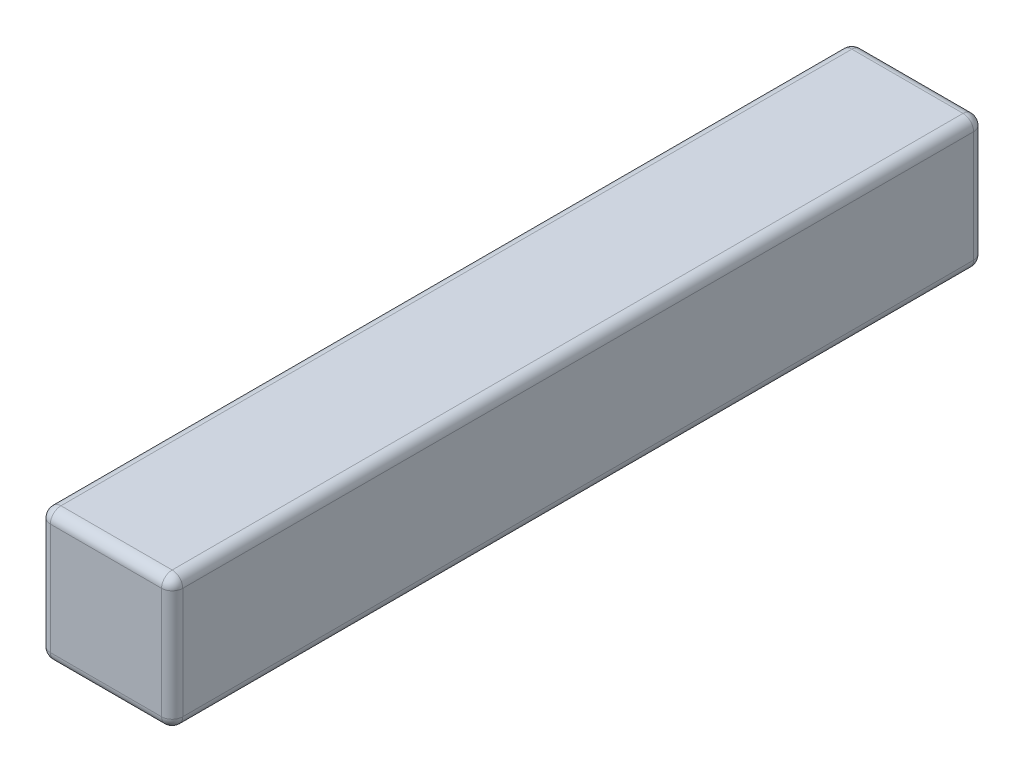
ISO-10303-21;
HEADER;
FILE_DESCRIPTION(('STEP AP214'),'2;1');
FILE_NAME('part.step','',(''),(''),'','','');
FILE_SCHEMA(('AUTOMOTIVE_DESIGN { 1 0 10303 214 1 1 1 1 }'));
ENDSEC;
DATA;
#1=APPLICATION_CONTEXT('core data for automotive mechanical design processes');
#2=APPLICATION_PROTOCOL_DEFINITION('international standard','automotive_design',2000,#1);
#3=PRODUCT_CONTEXT('',#1,'mechanical');
#4=PRODUCT('Part','Part','',(#3));
#5=PRODUCT_RELATED_PRODUCT_CATEGORY('part','',(#4));
#6=PRODUCT_DEFINITION_FORMATION('','',#4);
#7=PRODUCT_DEFINITION_CONTEXT('part definition',#1,'design');
#8=PRODUCT_DEFINITION('design','',#6,#7);
#9=PRODUCT_DEFINITION_SHAPE('','',#8);
#10=(LENGTH_UNIT() NAMED_UNIT(*) SI_UNIT(.MILLI.,.METRE.));
#11=(NAMED_UNIT(*) PLANE_ANGLE_UNIT() SI_UNIT($,.RADIAN.));
#12=(NAMED_UNIT(*) SI_UNIT($,.STERADIAN.) SOLID_ANGLE_UNIT());
#13=UNCERTAINTY_MEASURE_WITH_UNIT(LENGTH_MEASURE(1.E-05),#10,'distance_accuracy_value','');
#14=(GEOMETRIC_REPRESENTATION_CONTEXT(3) GLOBAL_UNCERTAINTY_ASSIGNED_CONTEXT((#13)) GLOBAL_UNIT_ASSIGNED_CONTEXT((#10,
#11,#12)) REPRESENTATION_CONTEXT('',''));
#15=CARTESIAN_POINT('',(0.,0.,0.));
#16=DIRECTION('',(0.,0.,1.));
#17=DIRECTION('',(1.,0.,0.));
#18=AXIS2_PLACEMENT_3D('',#15,#16,#17);
#19=CARTESIAN_POINT('',(18.75,18.75,115.));
#20=DIRECTION('',(-1.,0.,0.));
#21=DIRECTION('',(0.,-1.,0.));
#22=AXIS2_PLACEMENT_3D('',#19,#20,#21);
#23=PLANE('',#22);
#24=DIRECTION('',(0.,1.,0.));
#25=VECTOR('',#24,1.);
#26=CARTESIAN_POINT('',(18.75,-18.75,112.));
#27=LINE('',#26,#25);
#28=CARTESIAN_POINT('',(18.75,15.75,112.));
#29=VERTEX_POINT('',#28);
#30=CARTESIAN_POINT('',(18.75,-15.75,112.));
#31=VERTEX_POINT('',#30);
#32=EDGE_CURVE('E215',#29,#31,#27,.F.);
#33=ORIENTED_EDGE('',*,*,#32,.T.);
#34=DIRECTION('',(0.,0.,-1.));
#35=VECTOR('',#34,1.);
#36=CARTESIAN_POINT('',(18.75,-15.75,115.));
#37=LINE('',#36,#35);
#38=CARTESIAN_POINT('',(18.75,-15.75,-112.));
#39=VERTEX_POINT('',#38);
#40=EDGE_CURVE('E218',#31,#39,#37,.T.);
#41=ORIENTED_EDGE('',*,*,#40,.T.);
#42=DIRECTION('',(0.,1.,0.));
#43=VECTOR('',#42,1.);
#44=CARTESIAN_POINT('',(18.75,18.75,-112.));
#45=LINE('',#44,#43);
#46=CARTESIAN_POINT('',(18.75,15.75,-112.));
#47=VERTEX_POINT('',#46);
#48=EDGE_CURVE('E212',#39,#47,#45,.T.);
#49=ORIENTED_EDGE('',*,*,#48,.T.);
#50=DIRECTION('',(0.,0.,-1.));
#51=VECTOR('',#50,1.);
#52=CARTESIAN_POINT('',(18.75,15.75,115.));
#53=LINE('',#52,#51);
#54=EDGE_CURVE('E209',#47,#29,#53,.F.);
#55=ORIENTED_EDGE('',*,*,#54,.T.);
#56=EDGE_LOOP('',(#33,#41,#49,#55));
#57=FACE_BOUND('',#56,.T.);
#58=ADVANCED_FACE('F39',(#57),#23,.F.);
#59=CARTESIAN_POINT('',(-18.75,18.75,115.));
#60=DIRECTION('',(0.,-1.,0.));
#61=DIRECTION('',(0.,0.,-1.));
#62=AXIS2_PLACEMENT_3D('',#59,#60,#61);
#63=PLANE('',#62);
#64=DIRECTION('',(-1.,0.,0.));
#65=VECTOR('',#64,1.);
#66=CARTESIAN_POINT('',(18.75,18.75,112.));
#67=LINE('',#66,#65);
#68=CARTESIAN_POINT('',(-15.75,18.75,112.));
#69=VERTEX_POINT('',#68);
#70=CARTESIAN_POINT('',(15.75,18.75,112.));
#71=VERTEX_POINT('',#70);
#72=EDGE_CURVE('E49',#69,#71,#67,.F.);
#73=ORIENTED_EDGE('',*,*,#72,.T.);
#74=DIRECTION('',(0.,0.,-1.));
#75=VECTOR('',#74,1.);
#76=CARTESIAN_POINT('',(15.75,18.75,115.));
#77=LINE('',#76,#75);
#78=CARTESIAN_POINT('',(15.75,18.75,-112.));
#79=VERTEX_POINT('',#78);
#80=EDGE_CURVE('E11',#71,#79,#77,.T.);
#81=ORIENTED_EDGE('',*,*,#80,.T.);
#82=DIRECTION('',(-1.,0.,0.));
#83=VECTOR('',#82,1.);
#84=CARTESIAN_POINT('',(-18.75,18.75,-112.));
#85=LINE('',#84,#83);
#86=CARTESIAN_POINT('',(-15.75,18.75,-112.));
#87=VERTEX_POINT('',#86);
#88=EDGE_CURVE('E222',#79,#87,#85,.T.);
#89=ORIENTED_EDGE('',*,*,#88,.T.);
#90=DIRECTION('',(0.,0.,-1.));
#91=VECTOR('',#90,1.);
#92=CARTESIAN_POINT('',(-15.75,18.75,115.));
#93=LINE('',#92,#91);
#94=EDGE_CURVE('E60',#87,#69,#93,.F.);
#95=ORIENTED_EDGE('',*,*,#94,.T.);
#96=EDGE_LOOP('',(#73,#81,#89,#95));
#97=FACE_BOUND('',#96,.T.);
#98=ADVANCED_FACE('F349',(#97),#63,.F.);
#99=CARTESIAN_POINT('',(-18.75,18.75,115.));
#100=DIRECTION('',(1.,0.,0.));
#101=DIRECTION('',(0.,0.,-1.));
#102=AXIS2_PLACEMENT_3D('',#99,#100,#101);
#103=PLANE('',#102);
#104=DIRECTION('',(0.,-1.,0.));
#105=VECTOR('',#104,1.);
#106=CARTESIAN_POINT('',(-18.75,18.75,-112.));
#107=LINE('',#106,#105);
#108=CARTESIAN_POINT('',(-18.75,15.75,-112.));
#109=VERTEX_POINT('',#108);
#110=CARTESIAN_POINT('',(-18.75,-15.75,-112.));
#111=VERTEX_POINT('',#110);
#112=EDGE_CURVE('E189',#109,#111,#107,.T.);
#113=ORIENTED_EDGE('',*,*,#112,.T.);
#114=DIRECTION('',(0.,0.,-1.));
#115=VECTOR('',#114,1.);
#116=CARTESIAN_POINT('',(-18.75,-15.75,115.));
#117=LINE('',#116,#115);
#118=CARTESIAN_POINT('',(-18.75,-15.75,112.));
#119=VERTEX_POINT('',#118);
#120=EDGE_CURVE('E192',#111,#119,#117,.F.);
#121=ORIENTED_EDGE('',*,*,#120,.T.);
#122=DIRECTION('',(0.,-1.,0.));
#123=VECTOR('',#122,1.);
#124=CARTESIAN_POINT('',(-18.75,18.75,112.));
#125=LINE('',#124,#123);
#126=CARTESIAN_POINT('',(-18.75,15.75,112.));
#127=VERTEX_POINT('',#126);
#128=EDGE_CURVE('E186',#119,#127,#125,.F.);
#129=ORIENTED_EDGE('',*,*,#128,.T.);
#130=DIRECTION('',(0.,0.,-1.));
#131=VECTOR('',#130,1.);
#132=CARTESIAN_POINT('',(-18.75,15.75,115.));
#133=LINE('',#132,#131);
#134=EDGE_CURVE('E183',#127,#109,#133,.T.);
#135=ORIENTED_EDGE('',*,*,#134,.T.);
#136=EDGE_LOOP('',(#113,#121,#129,#135));
#137=FACE_BOUND('',#136,.T.);
#138=ADVANCED_FACE('F321',(#137),#103,.F.);
#139=CARTESIAN_POINT('',(-18.75,-18.75,115.));
#140=DIRECTION('',(0.,1.,0.));
#141=DIRECTION('',(0.,0.,1.));
#142=AXIS2_PLACEMENT_3D('',#139,#140,#141);
#143=PLANE('',#142);
#144=DIRECTION('',(0.,0.,-1.));
#145=VECTOR('',#144,1.);
#146=CARTESIAN_POINT('',(-15.75,-18.75,115.));
#147=LINE('',#146,#145);
#148=CARTESIAN_POINT('',(-15.75,-18.75,112.));
#149=VERTEX_POINT('',#148);
#150=CARTESIAN_POINT('',(-15.75,-18.75,-112.));
#151=VERTEX_POINT('',#150);
#152=EDGE_CURVE('E164',#149,#151,#147,.T.);
#153=ORIENTED_EDGE('',*,*,#152,.T.);
#154=DIRECTION('',(1.,0.,0.));
#155=VECTOR('',#154,1.);
#156=CARTESIAN_POINT('',(-18.75,-18.75,-112.));
#157=LINE('',#156,#155);
#158=CARTESIAN_POINT('',(15.75,-18.75,-112.));
#159=VERTEX_POINT('',#158);
#160=EDGE_CURVE('E133',#151,#159,#157,.T.);
#161=ORIENTED_EDGE('',*,*,#160,.T.);
#162=DIRECTION('',(0.,0.,-1.));
#163=VECTOR('',#162,1.);
#164=CARTESIAN_POINT('',(15.75,-18.75,115.));
#165=LINE('',#164,#163);
#166=CARTESIAN_POINT('',(15.75,-18.75,112.));
#167=VERTEX_POINT('',#166);
#168=EDGE_CURVE('E153',#159,#167,#165,.F.);
#169=ORIENTED_EDGE('',*,*,#168,.T.);
#170=DIRECTION('',(1.,0.,0.));
#171=VECTOR('',#170,1.);
#172=CARTESIAN_POINT('',(-18.75,-18.75,112.));
#173=LINE('',#172,#171);
#174=EDGE_CURVE('E160',#167,#149,#173,.F.);
#175=ORIENTED_EDGE('',*,*,#174,.T.);
#176=EDGE_LOOP('',(#153,#161,#169,#175));
#177=FACE_BOUND('',#176,.T.);
#178=ADVANCED_FACE('F162',(#177),#143,.F.);
#179=CARTESIAN_POINT('',(0.,0.,115.));
#180=DIRECTION('',(0.,0.,1.));
#181=DIRECTION('',(1.,0.,0.));
#182=AXIS2_PLACEMENT_3D('',#179,#180,#181);
#183=PLANE('',#182);
#184=DIRECTION('',(0.,-1.,0.));
#185=VECTOR('',#184,1.);
#186=CARTESIAN_POINT('',(-15.75,-18.75,115.));
#187=LINE('',#186,#185);
#188=CARTESIAN_POINT('',(-15.75,15.75,115.));
#189=VERTEX_POINT('',#188);
#190=CARTESIAN_POINT('',(-15.75,-15.75,115.));
#191=VERTEX_POINT('',#190);
#192=EDGE_CURVE('E202',#189,#191,#187,.T.);
#193=ORIENTED_EDGE('',*,*,#192,.T.);
#194=DIRECTION('',(1.,0.,0.));
#195=VECTOR('',#194,1.);
#196=CARTESIAN_POINT('',(18.75,-15.75,115.));
#197=LINE('',#196,#195);
#198=CARTESIAN_POINT('',(15.75,-15.75,115.));
#199=VERTEX_POINT('',#198);
#200=EDGE_CURVE('E205',#191,#199,#197,.T.);
#201=ORIENTED_EDGE('',*,*,#200,.T.);
#202=DIRECTION('',(0.,1.,0.));
#203=VECTOR('',#202,1.);
#204=CARTESIAN_POINT('',(15.75,18.75,115.));
#205=LINE('',#204,#203);
#206=CARTESIAN_POINT('',(15.75,15.75,115.));
#207=VERTEX_POINT('',#206);
#208=EDGE_CURVE('E199',#199,#207,#205,.T.);
#209=ORIENTED_EDGE('',*,*,#208,.T.);
#210=DIRECTION('',(-1.,0.,0.));
#211=VECTOR('',#210,1.);
#212=CARTESIAN_POINT('',(-18.75,15.75,115.));
#213=LINE('',#212,#211);
#214=EDGE_CURVE('E196',#207,#189,#213,.T.);
#215=ORIENTED_EDGE('',*,*,#214,.T.);
#216=EDGE_LOOP('',(#193,#201,#209,#215));
#217=FACE_BOUND('',#216,.T.);
#218=ADVANCED_FACE('F330',(#217),#183,.T.);
#219=CARTESIAN_POINT('',(0.,0.,-115.));
#220=DIRECTION('',(0.,0.,1.));
#221=DIRECTION('',(1.,0.,0.));
#222=AXIS2_PLACEMENT_3D('',#219,#220,#221);
#223=PLANE('',#222);
#224=DIRECTION('',(0.,1.,0.));
#225=VECTOR('',#224,1.);
#226=CARTESIAN_POINT('',(15.75,0.,-115.));
#227=LINE('',#226,#225);
#228=CARTESIAN_POINT('',(15.75,15.75,-115.));
#229=VERTEX_POINT('',#228);
#230=CARTESIAN_POINT('',(15.75,-15.75,-115.));
#231=VERTEX_POINT('',#230);
#232=EDGE_CURVE('E171',#229,#231,#227,.F.);
#233=ORIENTED_EDGE('',*,*,#232,.T.);
#234=DIRECTION('',(1.,0.,0.));
#235=VECTOR('',#234,1.);
#236=CARTESIAN_POINT('',(0.,-15.75,-115.));
#237=LINE('',#236,#235);
#238=CARTESIAN_POINT('',(-15.75,-15.75,-115.));
#239=VERTEX_POINT('',#238);
#240=EDGE_CURVE('E135',#231,#239,#237,.F.);
#241=ORIENTED_EDGE('',*,*,#240,.T.);
#242=DIRECTION('',(0.,-1.,0.));
#243=VECTOR('',#242,1.);
#244=CARTESIAN_POINT('',(-15.75,0.,-115.));
#245=LINE('',#244,#243);
#246=CARTESIAN_POINT('',(-15.75,15.75,-115.));
#247=VERTEX_POINT('',#246);
#248=EDGE_CURVE('E178',#239,#247,#245,.F.);
#249=ORIENTED_EDGE('',*,*,#248,.T.);
#250=DIRECTION('',(-1.,0.,0.));
#251=VECTOR('',#250,1.);
#252=CARTESIAN_POINT('',(0.,15.75,-115.));
#253=LINE('',#252,#251);
#254=EDGE_CURVE('E167',#247,#229,#253,.F.);
#255=ORIENTED_EDGE('',*,*,#254,.T.);
#256=EDGE_LOOP('',(#233,#241,#249,#255));
#257=FACE_BOUND('',#256,.T.);
#258=ADVANCED_FACE('F409',(#257),#223,.F.);
#259=CARTESIAN_POINT('',(0.,15.75,112.));
#260=DIRECTION('',(1.,0.,0.));
#261=DIRECTION('',(0.,0.,-1.));
#262=AXIS2_PLACEMENT_3D('',#259,#260,#261);
#263=CYLINDRICAL_SURFACE('',#262,3.);
#264=CARTESIAN_POINT('',(-15.75,15.75,112.));
#265=DIRECTION('',(-1.,0.,0.));
#266=DIRECTION('',(0.,0.,1.));
#267=AXIS2_PLACEMENT_3D('',#264,#265,#266);
#268=CIRCLE('',#267,3.);
#269=EDGE_CURVE('E43',#189,#69,#268,.T.);
#270=ORIENTED_EDGE('',*,*,#269,.F.);
#271=ORIENTED_EDGE('',*,*,#214,.F.);
#272=CARTESIAN_POINT('',(15.75,15.75,112.));
#273=DIRECTION('',(1.,0.,0.));
#274=DIRECTION('',(0.,0.,-1.));
#275=AXIS2_PLACEMENT_3D('',#272,#273,#274);
#276=CIRCLE('',#275,3.);
#277=EDGE_CURVE('E298',#71,#207,#276,.T.);
#278=ORIENTED_EDGE('',*,*,#277,.F.);
#279=ORIENTED_EDGE('',*,*,#72,.F.);
#280=EDGE_LOOP('',(#270,#271,#278,#279));
#281=FACE_BOUND('',#280,.T.);
#282=ADVANCED_FACE('F41',(#281),#263,.T.);
#283=CARTESIAN_POINT('',(-15.75,15.75,112.));
#284=DIRECTION('',(0.,0.,1.));
#285=DIRECTION('',(1.,0.,0.));
#286=AXIS2_PLACEMENT_3D('',#283,#284,#285);
#287=SPHERICAL_SURFACE('',#286,3.);
#288=CARTESIAN_POINT('',(-15.75,15.75,112.));
#289=DIRECTION('',(0.,1.,0.));
#290=DIRECTION('',(0.,0.,1.));
#291=AXIS2_PLACEMENT_3D('',#288,#289,#290);
#292=CIRCLE('',#291,3.);
#293=EDGE_CURVE('E291',#189,#127,#292,.F.);
#294=ORIENTED_EDGE('',*,*,#293,.F.);
#295=ORIENTED_EDGE('',*,*,#269,.T.);
#296=CARTESIAN_POINT('',(-15.75,15.75,112.));
#297=DIRECTION('',(0.,0.,1.));
#298=DIRECTION('',(1.,0.,0.));
#299=AXIS2_PLACEMENT_3D('',#296,#297,#298);
#300=CIRCLE('',#299,3.);
#301=EDGE_CURVE('E295',#127,#69,#300,.F.);
#302=ORIENTED_EDGE('',*,*,#301,.F.);
#303=EDGE_LOOP('',(#294,#295,#302));
#304=FACE_BOUND('',#303,.T.);
#305=ADVANCED_FACE('F310',(#304),#287,.T.);
#306=CARTESIAN_POINT('',(15.75,15.75,112.));
#307=DIRECTION('',(0.,0.,1.));
#308=DIRECTION('',(1.,0.,0.));
#309=AXIS2_PLACEMENT_3D('',#306,#307,#308);
#310=SPHERICAL_SURFACE('',#309,3.);
#311=CARTESIAN_POINT('',(15.75,15.75,112.));
#312=DIRECTION('',(0.,0.,1.));
#313=DIRECTION('',(1.,0.,0.));
#314=AXIS2_PLACEMENT_3D('',#311,#312,#313);
#315=CIRCLE('',#314,3.);
#316=EDGE_CURVE('E283',#71,#29,#315,.F.);
#317=ORIENTED_EDGE('',*,*,#316,.F.);
#318=ORIENTED_EDGE('',*,*,#277,.T.);
#319=CARTESIAN_POINT('',(15.75,15.75,112.));
#320=DIRECTION('',(0.,1.,0.));
#321=DIRECTION('',(0.,0.,1.));
#322=AXIS2_PLACEMENT_3D('',#319,#320,#321);
#323=CIRCLE('',#322,3.);
#324=EDGE_CURVE('E287',#29,#207,#323,.F.);
#325=ORIENTED_EDGE('',*,*,#324,.F.);
#326=EDGE_LOOP('',(#317,#318,#325));
#327=FACE_BOUND('',#326,.T.);
#328=ADVANCED_FACE('F343',(#327),#310,.T.);
#329=CARTESIAN_POINT('',(-15.75,15.75,115.));
#330=DIRECTION('',(0.,0.,-1.));
#331=DIRECTION('',(-1.,0.,0.));
#332=AXIS2_PLACEMENT_3D('',#329,#330,#331);
#333=CYLINDRICAL_SURFACE('',#332,3.);
#334=ORIENTED_EDGE('',*,*,#301,.T.);
#335=ORIENTED_EDGE('',*,*,#94,.F.);
#336=CARTESIAN_POINT('',(-15.75,15.75,-112.));
#337=DIRECTION('',(0.,0.,-1.));
#338=DIRECTION('',(-1.,0.,0.));
#339=AXIS2_PLACEMENT_3D('',#336,#337,#338);
#340=CIRCLE('',#339,3.);
#341=EDGE_CURVE('E275',#109,#87,#340,.T.);
#342=ORIENTED_EDGE('',*,*,#341,.F.);
#343=ORIENTED_EDGE('',*,*,#134,.F.);
#344=EDGE_LOOP('',(#334,#335,#342,#343));
#345=FACE_BOUND('',#344,.T.);
#346=ADVANCED_FACE('F316',(#345),#333,.T.);
#347=CARTESIAN_POINT('',(-15.75,0.,112.));
#348=DIRECTION('',(0.,1.,0.));
#349=DIRECTION('',(0.,0.,1.));
#350=AXIS2_PLACEMENT_3D('',#347,#348,#349);
#351=CYLINDRICAL_SURFACE('',#350,3.);
#352=ORIENTED_EDGE('',*,*,#293,.T.);
#353=ORIENTED_EDGE('',*,*,#128,.F.);
#354=CARTESIAN_POINT('',(-15.75,-15.75,112.));
#355=DIRECTION('',(0.,-1.,0.));
#356=DIRECTION('',(0.,0.,-1.));
#357=AXIS2_PLACEMENT_3D('',#354,#355,#356);
#358=CIRCLE('',#357,3.);
#359=EDGE_CURVE('E271',#191,#119,#358,.T.);
#360=ORIENTED_EDGE('',*,*,#359,.F.);
#361=ORIENTED_EDGE('',*,*,#192,.F.);
#362=EDGE_LOOP('',(#352,#353,#360,#361));
#363=FACE_BOUND('',#362,.T.);
#364=ADVANCED_FACE('F327',(#363),#351,.T.);
#365=CARTESIAN_POINT('',(0.,-15.75,112.));
#366=DIRECTION('',(-1.,0.,0.));
#367=DIRECTION('',(0.,0.,1.));
#368=AXIS2_PLACEMENT_3D('',#365,#366,#367);
#369=CYLINDRICAL_SURFACE('',#368,3.);
#370=CARTESIAN_POINT('',(15.75,-15.75,112.));
#371=DIRECTION('',(1.,0.,0.));
#372=DIRECTION('',(0.,0.,-1.));
#373=AXIS2_PLACEMENT_3D('',#370,#371,#372);
#374=CIRCLE('',#373,3.);
#375=EDGE_CURVE('E263',#199,#167,#374,.T.);
#376=ORIENTED_EDGE('',*,*,#375,.F.);
#377=ORIENTED_EDGE('',*,*,#200,.F.);
#378=CARTESIAN_POINT('',(-15.75,-15.75,112.));
#379=DIRECTION('',(-1.,0.,0.));
#380=DIRECTION('',(0.,0.,1.));
#381=AXIS2_PLACEMENT_3D('',#378,#379,#380);
#382=CIRCLE('',#381,3.);
#383=EDGE_CURVE('E267',#149,#191,#382,.T.);
#384=ORIENTED_EDGE('',*,*,#383,.F.);
#385=ORIENTED_EDGE('',*,*,#174,.F.);
#386=EDGE_LOOP('',(#376,#377,#384,#385));
#387=FACE_BOUND('',#386,.T.);
#388=ADVANCED_FACE('F334',(#387),#369,.T.);
#389=CARTESIAN_POINT('',(15.75,0.,112.));
#390=DIRECTION('',(0.,-1.,0.));
#391=DIRECTION('',(1.,0.,0.));
#392=AXIS2_PLACEMENT_3D('',#389,#390,#391);
#393=CYLINDRICAL_SURFACE('',#392,3.);
#394=ORIENTED_EDGE('',*,*,#324,.T.);
#395=ORIENTED_EDGE('',*,*,#208,.F.);
#396=CARTESIAN_POINT('',(15.75,-15.75,112.));
#397=DIRECTION('',(0.,-1.,0.));
#398=DIRECTION('',(0.,0.,-1.));
#399=AXIS2_PLACEMENT_3D('',#396,#397,#398);
#400=CIRCLE('',#399,3.);
#401=EDGE_CURVE('E260',#31,#199,#400,.T.);
#402=ORIENTED_EDGE('',*,*,#401,.F.);
#403=ORIENTED_EDGE('',*,*,#32,.F.);
#404=EDGE_LOOP('',(#394,#395,#402,#403));
#405=FACE_BOUND('',#404,.T.);
#406=ADVANCED_FACE('F340',(#405),#393,.T.);
#407=CARTESIAN_POINT('',(15.75,15.75,115.));
#408=DIRECTION('',(0.,0.,-1.));
#409=DIRECTION('',(-1.,0.,0.));
#410=AXIS2_PLACEMENT_3D('',#407,#408,#409);
#411=CYLINDRICAL_SURFACE('',#410,3.);
#412=ORIENTED_EDGE('',*,*,#316,.T.);
#413=ORIENTED_EDGE('',*,*,#54,.F.);
#414=CARTESIAN_POINT('',(15.75,15.75,-112.));
#415=DIRECTION('',(0.,0.,-1.));
#416=DIRECTION('',(-1.,0.,0.));
#417=AXIS2_PLACEMENT_3D('',#414,#415,#416);
#418=CIRCLE('',#417,3.);
#419=EDGE_CURVE('E256',#79,#47,#418,.T.);
#420=ORIENTED_EDGE('',*,*,#419,.F.);
#421=ORIENTED_EDGE('',*,*,#80,.F.);
#422=EDGE_LOOP('',(#412,#413,#420,#421));
#423=FACE_BOUND('',#422,.T.);
#424=ADVANCED_FACE('F347',(#423),#411,.T.);
#425=CARTESIAN_POINT('',(-18.75,15.75,-112.));
#426=DIRECTION('',(-1.,0.,0.));
#427=DIRECTION('',(0.,0.,1.));
#428=AXIS2_PLACEMENT_3D('',#425,#426,#427);
#429=CYLINDRICAL_SURFACE('',#428,3.);
#430=CARTESIAN_POINT('',(-15.75,15.75,-112.));
#431=DIRECTION('',(-1.,0.,0.));
#432=DIRECTION('',(0.,0.,1.));
#433=AXIS2_PLACEMENT_3D('',#430,#431,#432);
#434=CIRCLE('',#433,3.);
#435=EDGE_CURVE('E279',#87,#247,#434,.T.);
#436=ORIENTED_EDGE('',*,*,#435,.F.);
#437=ORIENTED_EDGE('',*,*,#88,.F.);
#438=CARTESIAN_POINT('',(15.75,15.75,-112.));
#439=DIRECTION('',(1.,0.,0.));
#440=DIRECTION('',(0.,1.,0.));
#441=AXIS2_PLACEMENT_3D('',#438,#439,#440);
#442=CIRCLE('',#441,3.);
#443=EDGE_CURVE('E253',#229,#79,#442,.T.);
#444=ORIENTED_EDGE('',*,*,#443,.F.);
#445=ORIENTED_EDGE('',*,*,#254,.F.);
#446=EDGE_LOOP('',(#436,#437,#444,#445));
#447=FACE_BOUND('',#446,.T.);
#448=ADVANCED_FACE('F352',(#447),#429,.T.);
#449=CARTESIAN_POINT('',(-15.75,15.75,-112.));
#450=DIRECTION('',(0.,0.,1.));
#451=DIRECTION('',(1.,0.,0.));
#452=AXIS2_PLACEMENT_3D('',#449,#450,#451);
#453=SPHERICAL_SURFACE('',#452,3.);
#454=ORIENTED_EDGE('',*,*,#341,.T.);
#455=ORIENTED_EDGE('',*,*,#435,.T.);
#456=CARTESIAN_POINT('',(-15.75,15.75,-112.));
#457=DIRECTION('',(0.,1.,0.));
#458=DIRECTION('',(0.,0.,1.));
#459=AXIS2_PLACEMENT_3D('',#456,#457,#458);
#460=CIRCLE('',#459,3.);
#461=EDGE_CURVE('E249',#109,#247,#460,.F.);
#462=ORIENTED_EDGE('',*,*,#461,.F.);
#463=EDGE_LOOP('',(#454,#455,#462));
#464=FACE_BOUND('',#463,.T.);
#465=ADVANCED_FACE('F356',(#464),#453,.T.);
#466=CARTESIAN_POINT('',(-15.75,-15.75,112.));
#467=DIRECTION('',(0.,0.,1.));
#468=DIRECTION('',(1.,0.,0.));
#469=AXIS2_PLACEMENT_3D('',#466,#467,#468);
#470=SPHERICAL_SURFACE('',#469,3.);
#471=ORIENTED_EDGE('',*,*,#383,.T.);
#472=ORIENTED_EDGE('',*,*,#359,.T.);
#473=CARTESIAN_POINT('',(-15.75,-15.75,112.));
#474=DIRECTION('',(0.,0.,1.));
#475=DIRECTION('',(1.,0.,0.));
#476=AXIS2_PLACEMENT_3D('',#473,#474,#475);
#477=CIRCLE('',#476,3.);
#478=EDGE_CURVE('E246',#149,#119,#477,.F.);
#479=ORIENTED_EDGE('',*,*,#478,.F.);
#480=EDGE_LOOP('',(#471,#472,#479));
#481=FACE_BOUND('',#480,.T.);
#482=ADVANCED_FACE('F367',(#481),#470,.T.);
#483=CARTESIAN_POINT('',(15.75,-15.75,112.));
#484=DIRECTION('',(0.,0.,1.));
#485=DIRECTION('',(1.,0.,0.));
#486=AXIS2_PLACEMENT_3D('',#483,#484,#485);
#487=SPHERICAL_SURFACE('',#486,3.);
#488=ORIENTED_EDGE('',*,*,#401,.T.);
#489=ORIENTED_EDGE('',*,*,#375,.T.);
#490=CARTESIAN_POINT('',(15.75,-15.75,112.));
#491=DIRECTION('',(0.,0.,1.));
#492=DIRECTION('',(1.,0.,0.));
#493=AXIS2_PLACEMENT_3D('',#490,#491,#492);
#494=CIRCLE('',#493,3.);
#495=EDGE_CURVE('E156',#31,#167,#494,.F.);
#496=ORIENTED_EDGE('',*,*,#495,.F.);
#497=EDGE_LOOP('',(#488,#489,#496));
#498=FACE_BOUND('',#497,.T.);
#499=ADVANCED_FACE('F369',(#498),#487,.T.);
#500=CARTESIAN_POINT('',(15.75,15.75,-112.));
#501=DIRECTION('',(0.,0.,1.));
#502=DIRECTION('',(1.,0.,0.));
#503=AXIS2_PLACEMENT_3D('',#500,#501,#502);
#504=SPHERICAL_SURFACE('',#503,3.);
#505=ORIENTED_EDGE('',*,*,#443,.T.);
#506=ORIENTED_EDGE('',*,*,#419,.T.);
#507=CARTESIAN_POINT('',(15.75,15.75,-112.));
#508=DIRECTION('',(0.,1.,0.));
#509=DIRECTION('',(0.,0.,1.));
#510=AXIS2_PLACEMENT_3D('',#507,#508,#509);
#511=CIRCLE('',#510,3.);
#512=EDGE_CURVE('E240',#229,#47,#511,.F.);
#513=ORIENTED_EDGE('',*,*,#512,.F.);
#514=EDGE_LOOP('',(#505,#506,#513));
#515=FACE_BOUND('',#514,.T.);
#516=ADVANCED_FACE('F375',(#515),#504,.T.);
#517=CARTESIAN_POINT('',(-15.75,18.75,-112.));
#518=DIRECTION('',(0.,-1.,0.));
#519=DIRECTION('',(0.,0.,-1.));
#520=AXIS2_PLACEMENT_3D('',#517,#518,#519);
#521=CYLINDRICAL_SURFACE('',#520,3.);
#522=ORIENTED_EDGE('',*,*,#461,.T.);
#523=ORIENTED_EDGE('',*,*,#248,.F.);
#524=CARTESIAN_POINT('',(-15.75,-15.75,-112.));
#525=DIRECTION('',(0.,-1.,0.));
#526=DIRECTION('',(0.,0.,-1.));
#527=AXIS2_PLACEMENT_3D('',#524,#525,#526);
#528=CIRCLE('',#527,3.);
#529=EDGE_CURVE('E236',#111,#239,#528,.T.);
#530=ORIENTED_EDGE('',*,*,#529,.F.);
#531=ORIENTED_EDGE('',*,*,#112,.F.);
#532=EDGE_LOOP('',(#522,#523,#530,#531));
#533=FACE_BOUND('',#532,.T.);
#534=ADVANCED_FACE('F360',(#533),#521,.T.);
#535=CARTESIAN_POINT('',(-15.75,-15.75,115.));
#536=DIRECTION('',(0.,0.,-1.));
#537=DIRECTION('',(-1.,0.,0.));
#538=AXIS2_PLACEMENT_3D('',#535,#536,#537);
#539=CYLINDRICAL_SURFACE('',#538,3.);
#540=ORIENTED_EDGE('',*,*,#478,.T.);
#541=ORIENTED_EDGE('',*,*,#120,.F.);
#542=CARTESIAN_POINT('',(-15.75,-15.75,-112.));
#543=DIRECTION('',(0.,0.,-1.));
#544=DIRECTION('',(-1.,0.,0.));
#545=AXIS2_PLACEMENT_3D('',#542,#543,#544);
#546=CIRCLE('',#545,3.);
#547=EDGE_CURVE('E150',#151,#111,#546,.T.);
#548=ORIENTED_EDGE('',*,*,#547,.F.);
#549=ORIENTED_EDGE('',*,*,#152,.F.);
#550=EDGE_LOOP('',(#540,#541,#548,#549));
#551=FACE_BOUND('',#550,.T.);
#552=ADVANCED_FACE('F365',(#551),#539,.T.);
#553=CARTESIAN_POINT('',(15.75,-15.75,115.));
#554=DIRECTION('',(0.,0.,-1.));
#555=DIRECTION('',(-1.,0.,0.));
#556=AXIS2_PLACEMENT_3D('',#553,#554,#555);
#557=CYLINDRICAL_SURFACE('',#556,3.);
#558=ORIENTED_EDGE('',*,*,#495,.T.);
#559=ORIENTED_EDGE('',*,*,#168,.F.);
#560=CARTESIAN_POINT('',(15.75,-15.75,-112.));
#561=DIRECTION('',(0.,0.,-1.));
#562=DIRECTION('',(-1.,0.,0.));
#563=AXIS2_PLACEMENT_3D('',#560,#561,#562);
#564=CIRCLE('',#563,3.);
#565=EDGE_CURVE('E141',#39,#159,#564,.T.);
#566=ORIENTED_EDGE('',*,*,#565,.F.);
#567=ORIENTED_EDGE('',*,*,#40,.F.);
#568=EDGE_LOOP('',(#558,#559,#566,#567));
#569=FACE_BOUND('',#568,.T.);
#570=ADVANCED_FACE('F154',(#569),#557,.T.);
#571=CARTESIAN_POINT('',(15.75,18.75,-112.));
#572=DIRECTION('',(0.,1.,0.));
#573=DIRECTION('',(-1.,0.,0.));
#574=AXIS2_PLACEMENT_3D('',#571,#572,#573);
#575=CYLINDRICAL_SURFACE('',#574,3.);
#576=ORIENTED_EDGE('',*,*,#512,.T.);
#577=ORIENTED_EDGE('',*,*,#48,.F.);
#578=CARTESIAN_POINT('',(15.75,-15.75,-112.));
#579=DIRECTION('',(0.,-1.,0.));
#580=DIRECTION('',(1.,0.,0.));
#581=AXIS2_PLACEMENT_3D('',#578,#579,#580);
#582=CIRCLE('',#581,3.);
#583=EDGE_CURVE('E145',#231,#39,#582,.T.);
#584=ORIENTED_EDGE('',*,*,#583,.F.);
#585=ORIENTED_EDGE('',*,*,#232,.F.);
#586=EDGE_LOOP('',(#576,#577,#584,#585));
#587=FACE_BOUND('',#586,.T.);
#588=ADVANCED_FACE('F393',(#587),#575,.T.);
#589=CARTESIAN_POINT('',(-15.75,-15.75,-112.));
#590=DIRECTION('',(0.,0.,1.));
#591=DIRECTION('',(1.,0.,0.));
#592=AXIS2_PLACEMENT_3D('',#589,#590,#591);
#593=SPHERICAL_SURFACE('',#592,3.);
#594=ORIENTED_EDGE('',*,*,#547,.T.);
#595=ORIENTED_EDGE('',*,*,#529,.T.);
#596=CARTESIAN_POINT('',(-15.75,-15.75,-112.));
#597=DIRECTION('',(-1.,0.,0.));
#598=DIRECTION('',(0.,0.,1.));
#599=AXIS2_PLACEMENT_3D('',#596,#597,#598);
#600=CIRCLE('',#599,3.);
#601=EDGE_CURVE('E138',#151,#239,#600,.F.);
#602=ORIENTED_EDGE('',*,*,#601,.F.);
#603=EDGE_LOOP('',(#594,#595,#602));
#604=FACE_BOUND('',#603,.T.);
#605=ADVANCED_FACE('F363',(#604),#593,.T.);
#606=CARTESIAN_POINT('',(15.75,-15.75,-112.));
#607=DIRECTION('',(0.,0.,1.));
#608=DIRECTION('',(1.,0.,0.));
#609=AXIS2_PLACEMENT_3D('',#606,#607,#608);
#610=SPHERICAL_SURFACE('',#609,3.);
#611=ORIENTED_EDGE('',*,*,#583,.T.);
#612=ORIENTED_EDGE('',*,*,#565,.T.);
#613=CARTESIAN_POINT('',(15.75,-15.75,-112.));
#614=DIRECTION('',(1.,0.,0.));
#615=DIRECTION('',(0.,0.,-1.));
#616=AXIS2_PLACEMENT_3D('',#613,#614,#615);
#617=CIRCLE('',#616,3.);
#618=EDGE_CURVE('E129',#231,#159,#617,.F.);
#619=ORIENTED_EDGE('',*,*,#618,.F.);
#620=EDGE_LOOP('',(#611,#612,#619));
#621=FACE_BOUND('',#620,.T.);
#622=ADVANCED_FACE('F143',(#621),#610,.T.);
#623=CARTESIAN_POINT('',(-18.75,-15.75,-112.));
#624=DIRECTION('',(1.,0.,0.));
#625=DIRECTION('',(0.,0.,-1.));
#626=AXIS2_PLACEMENT_3D('',#623,#624,#625);
#627=CYLINDRICAL_SURFACE('',#626,3.);
#628=ORIENTED_EDGE('',*,*,#601,.T.);
#629=ORIENTED_EDGE('',*,*,#240,.F.);
#630=ORIENTED_EDGE('',*,*,#618,.T.);
#631=ORIENTED_EDGE('',*,*,#160,.F.);
#632=EDGE_LOOP('',(#628,#629,#630,#631));
#633=FACE_BOUND('',#632,.T.);
#634=ADVANCED_FACE('F131',(#633),#627,.T.);
#635=CLOSED_SHELL('',(#58,#98,#138,#178,#218,#258,#282,#305,#328,#346,#364,#388,#406,#424,#448,
#465,#482,#499,#516,#534,#552,#570,#588,#605,#622,#634));
#636=MANIFOLD_SOLID_BREP('B2',#635);
#637=ADVANCED_BREP_SHAPE_REPRESENTATION('',(#18,#636),#14);
#638=SHAPE_DEFINITION_REPRESENTATION(#9,#637);
ENDSEC;
END-ISO-10303-21;
